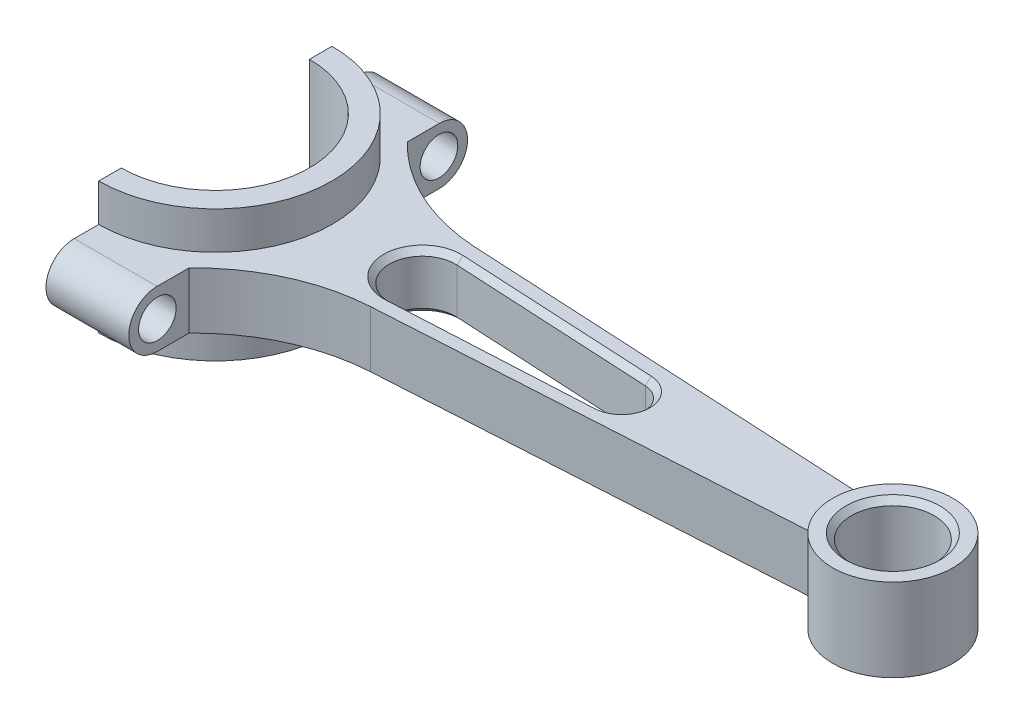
ISO-10303-21;
HEADER;
FILE_DESCRIPTION(('STEP AP214'),'2;1');
FILE_NAME('part.step','',(''),(''),'','','');
FILE_SCHEMA(('AUTOMOTIVE_DESIGN { 1 0 10303 214 1 1 1 1 }'));
ENDSEC;
DATA;
#1=APPLICATION_CONTEXT('core data for automotive mechanical design processes');
#2=APPLICATION_PROTOCOL_DEFINITION('international standard','automotive_design',2000,#1);
#3=PRODUCT_CONTEXT('',#1,'mechanical');
#4=PRODUCT('Part','Part','',(#3));
#5=PRODUCT_RELATED_PRODUCT_CATEGORY('part','',(#4));
#6=PRODUCT_DEFINITION_FORMATION('','',#4);
#7=PRODUCT_DEFINITION_CONTEXT('part definition',#1,'design');
#8=PRODUCT_DEFINITION('design','',#6,#7);
#9=PRODUCT_DEFINITION_SHAPE('','',#8);
#10=(LENGTH_UNIT() NAMED_UNIT(*) SI_UNIT(.MILLI.,.METRE.));
#11=(NAMED_UNIT(*) PLANE_ANGLE_UNIT() SI_UNIT($,.RADIAN.));
#12=(NAMED_UNIT(*) SI_UNIT($,.STERADIAN.) SOLID_ANGLE_UNIT());
#13=UNCERTAINTY_MEASURE_WITH_UNIT(LENGTH_MEASURE(1.E-05),#10,'distance_accuracy_value','');
#14=(GEOMETRIC_REPRESENTATION_CONTEXT(3) GLOBAL_UNCERTAINTY_ASSIGNED_CONTEXT((#13)) GLOBAL_UNIT_ASSIGNED_CONTEXT((#10,
#11,#12)) REPRESENTATION_CONTEXT('',''));
#15=CARTESIAN_POINT('',(0.,0.,0.));
#16=DIRECTION('',(0.,0.,1.));
#17=DIRECTION('',(1.,0.,0.));
#18=AXIS2_PLACEMENT_3D('',#15,#16,#17);
#19=CARTESIAN_POINT('',(22.,0.,-37.5));
#20=DIRECTION('',(1.,0.,0.));
#21=DIRECTION('',(0.,0.,-1.));
#22=AXIS2_PLACEMENT_3D('',#19,#20,#21);
#23=CYLINDRICAL_SURFACE('',#22,7.5);
#24=DIRECTION('',(1.,0.,0.));
#25=VECTOR('',#24,1.);
#26=CARTESIAN_POINT('',(0.,7.5,-37.5));
#27=LINE('',#26,#25);
#28=CARTESIAN_POINT('',(22.,7.5,-37.5));
#29=VERTEX_POINT('',#28);
#30=CARTESIAN_POINT('',(0.,7.5,-37.5));
#31=VERTEX_POINT('',#30);
#32=EDGE_CURVE('E350',#29,#31,#27,.F.);
#33=ORIENTED_EDGE('',*,*,#32,.F.);
#34=CARTESIAN_POINT('',(22.,0.,-37.5));
#35=DIRECTION('',(1.,0.,0.));
#36=DIRECTION('',(0.,0.,-1.));
#37=AXIS2_PLACEMENT_3D('',#34,#35,#36);
#38=CIRCLE('',#37,7.5);
#39=CARTESIAN_POINT('',(22.,-7.5,-37.5));
#40=VERTEX_POINT('',#39);
#41=EDGE_CURVE('E356',#40,#29,#38,.T.);
#42=ORIENTED_EDGE('',*,*,#41,.F.);
#43=DIRECTION('',(-1.,0.,0.));
#44=VECTOR('',#43,1.);
#45=CARTESIAN_POINT('',(22.,-7.5,-37.5));
#46=LINE('',#45,#44);
#47=CARTESIAN_POINT('',(0.,-7.5,-37.5));
#48=VERTEX_POINT('',#47);
#49=EDGE_CURVE('E353',#48,#40,#46,.F.);
#50=ORIENTED_EDGE('',*,*,#49,.F.);
#51=CARTESIAN_POINT('',(0.,0.,-37.5));
#52=DIRECTION('',(-1.,0.,0.));
#53=DIRECTION('',(0.,0.,1.));
#54=AXIS2_PLACEMENT_3D('',#51,#52,#53);
#55=CIRCLE('',#54,7.5);
#56=EDGE_CURVE('E358',#31,#48,#55,.T.);
#57=ORIENTED_EDGE('',*,*,#56,.F.);
#58=EDGE_LOOP('',(#33,#42,#50,#57));
#59=FACE_BOUND('',#58,.T.);
#60=ADVANCED_FACE('F41',(#59),#23,.T.);
#61=CARTESIAN_POINT('',(0.,0.,37.5));
#62=DIRECTION('',(1.,0.,0.));
#63=DIRECTION('',(0.,0.,-1.));
#64=AXIS2_PLACEMENT_3D('',#61,#62,#63);
#65=CYLINDRICAL_SURFACE('',#64,7.5);
#66=DIRECTION('',(-1.,0.,0.));
#67=VECTOR('',#66,1.);
#68=CARTESIAN_POINT('',(0.,7.5,37.5));
#69=LINE('',#68,#67);
#70=CARTESIAN_POINT('',(0.,7.5,37.5));
#71=VERTEX_POINT('',#70);
#72=CARTESIAN_POINT('',(22.,7.5,37.5));
#73=VERTEX_POINT('',#72);
#74=EDGE_CURVE('E330',#71,#73,#69,.F.);
#75=ORIENTED_EDGE('',*,*,#74,.F.);
#76=CARTESIAN_POINT('',(0.,0.,37.5));
#77=DIRECTION('',(-1.,0.,0.));
#78=DIRECTION('',(0.,0.,1.));
#79=AXIS2_PLACEMENT_3D('',#76,#77,#78);
#80=CIRCLE('',#79,7.5);
#81=CARTESIAN_POINT('',(0.,-7.5,37.5));
#82=VERTEX_POINT('',#81);
#83=EDGE_CURVE('E346',#82,#71,#80,.T.);
#84=ORIENTED_EDGE('',*,*,#83,.F.);
#85=DIRECTION('',(1.,0.,0.));
#86=VECTOR('',#85,1.);
#87=CARTESIAN_POINT('',(0.,-7.5,37.5));
#88=LINE('',#87,#86);
#89=CARTESIAN_POINT('',(22.,-7.5,37.5));
#90=VERTEX_POINT('',#89);
#91=EDGE_CURVE('E343',#90,#82,#88,.F.);
#92=ORIENTED_EDGE('',*,*,#91,.F.);
#93=CARTESIAN_POINT('',(22.,0.,37.5));
#94=DIRECTION('',(-1.,0.,0.));
#95=DIRECTION('',(0.,0.,1.));
#96=AXIS2_PLACEMENT_3D('',#93,#94,#95);
#97=CIRCLE('',#96,7.5);
#98=EDGE_CURVE('E348',#73,#90,#97,.F.);
#99=ORIENTED_EDGE('',*,*,#98,.F.);
#100=EDGE_LOOP('',(#75,#84,#92,#99));
#101=FACE_BOUND('',#100,.T.);
#102=ADVANCED_FACE('F496',(#101),#65,.T.);
#103=CARTESIAN_POINT('',(0.871308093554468,7.5,-16.6255488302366));
#104=DIRECTION('',(0.052335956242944,0.,-0.998629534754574));
#105=DIRECTION('',(-0.998629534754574,0.,-0.052335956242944));
#106=AXIS2_PLACEMENT_3D('',#103,#104,#105);
#107=PLANE('',#106);
#108=DIRECTION('',(0.998629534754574,0.,0.052335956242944));
#109=VECTOR('',#108,1.);
#110=CARTESIAN_POINT('',(0.871308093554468,-7.5,-16.6255488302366));
#111=LINE('',#110,#109);
#112=CARTESIAN_POINT('',(55.,-7.5,-13.7887842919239));
#113=VERTEX_POINT('',#112);
#114=CARTESIAN_POINT('',(166.123473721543,-7.5,-7.96504980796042));
#115=VERTEX_POINT('',#114);
#116=EDGE_CURVE('E290',#113,#115,#111,.T.);
#117=ORIENTED_EDGE('',*,*,#116,.F.);
#118=DIRECTION('',(0.,-1.,0.));
#119=VECTOR('',#118,1.);
#120=CARTESIAN_POINT('',(55.,7.5,-13.7887842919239));
#121=LINE('',#120,#119);
#122=CARTESIAN_POINT('',(55.,7.5,-13.7887842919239));
#123=VERTEX_POINT('',#122);
#124=EDGE_CURVE('E325',#123,#113,#121,.T.);
#125=ORIENTED_EDGE('',*,*,#124,.F.);
#126=DIRECTION('',(0.998629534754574,0.,0.052335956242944));
#127=VECTOR('',#126,1.);
#128=CARTESIAN_POINT('',(0.871308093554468,7.5,-16.6255488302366));
#129=LINE('',#128,#127);
#130=CARTESIAN_POINT('',(166.123473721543,7.5,-7.96504980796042));
#131=VERTEX_POINT('',#130);
#132=EDGE_CURVE('E265',#123,#131,#129,.T.);
#133=ORIENTED_EDGE('',*,*,#132,.T.);
#134=DIRECTION('',(0.,-1.,0.));
#135=VECTOR('',#134,1.);
#136=CARTESIAN_POINT('',(166.123473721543,7.5,-7.96504980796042));
#137=LINE('',#136,#135);
#138=EDGE_CURVE('E327',#131,#115,#137,.T.);
#139=ORIENTED_EDGE('',*,*,#138,.T.);
#140=EDGE_LOOP('',(#117,#125,#133,#139));
#141=FACE_BOUND('',#140,.T.);
#142=ADVANCED_FACE('F514',(#141),#107,.T.);
#143=CARTESIAN_POINT('',(58.,7.5,-63.698703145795));
#144=DIRECTION('',(0.,-1.,0.));
#145=DIRECTION('',(0.,0.,-1.));
#146=AXIS2_PLACEMENT_3D('',#143,#144,#145);
#147=CYLINDRICAL_SURFACE('',#146,50.);
#148=CARTESIAN_POINT('',(58.,-7.5,-63.698703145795));
#149=DIRECTION('',(0.,1.,0.));
#150=DIRECTION('',(0.,0.,1.));
#151=AXIS2_PLACEMENT_3D('',#148,#149,#150);
#152=CIRCLE('',#151,50.);
#153=CARTESIAN_POINT('',(22.,-7.5,-29.));
#154=VERTEX_POINT('',#153);
#155=EDGE_CURVE('E293',#154,#113,#152,.T.);
#156=ORIENTED_EDGE('',*,*,#155,.F.);
#157=DIRECTION('',(0.,-1.,0.));
#158=VECTOR('',#157,1.);
#159=CARTESIAN_POINT('',(22.,7.5,-29.));
#160=LINE('',#159,#158);
#161=CARTESIAN_POINT('',(22.,7.5,-29.));
#162=VERTEX_POINT('',#161);
#163=EDGE_CURVE('E322',#162,#154,#160,.T.);
#164=ORIENTED_EDGE('',*,*,#163,.F.);
#165=CARTESIAN_POINT('',(58.,7.5,-63.698703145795));
#166=DIRECTION('',(0.,1.,0.));
#167=DIRECTION('',(0.,0.,1.));
#168=AXIS2_PLACEMENT_3D('',#165,#166,#167);
#169=CIRCLE('',#168,50.);
#170=EDGE_CURVE('E269',#162,#123,#169,.T.);
#171=ORIENTED_EDGE('',*,*,#170,.T.);
#172=ORIENTED_EDGE('',*,*,#124,.T.);
#173=EDGE_LOOP('',(#156,#164,#171,#172));
#174=FACE_BOUND('',#173,.T.);
#175=ADVANCED_FACE('F482',(#174),#147,.F.);
#176=CARTESIAN_POINT('',(22.,7.5,0.));
#177=DIRECTION('',(1.,0.,0.));
#178=DIRECTION('',(0.,0.,-1.));
#179=AXIS2_PLACEMENT_3D('',#176,#177,#178);
#180=PLANE('',#179);
#181=CARTESIAN_POINT('',(22.,0.,-37.4068380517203));
#182=DIRECTION('',(1.,0.,0.));
#183=DIRECTION('',(0.,0.,-1.));
#184=AXIS2_PLACEMENT_3D('',#181,#182,#183);
#185=CIRCLE('',#184,5.00000000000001);
#186=CARTESIAN_POINT('',(22.,0.,-42.4068380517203));
#187=VERTEX_POINT('',#186);
#188=EDGE_CURVE('E413',#187,#187,#185,.T.);
#189=ORIENTED_EDGE('',*,*,#188,.F.);
#190=EDGE_LOOP('',(#189));
#191=FACE_BOUND('',#190,.T.);
#192=DIRECTION('',(0.,0.,1.));
#193=VECTOR('',#192,1.);
#194=CARTESIAN_POINT('',(22.,-7.5,0.));
#195=LINE('',#194,#193);
#196=EDGE_CURVE('E296',#40,#154,#195,.T.);
#197=ORIENTED_EDGE('',*,*,#196,.F.);
#198=ORIENTED_EDGE('',*,*,#41,.T.);
#199=DIRECTION('',(0.,0.,1.));
#200=VECTOR('',#199,1.);
#201=CARTESIAN_POINT('',(22.,7.5,0.));
#202=LINE('',#201,#200);
#203=EDGE_CURVE('E272',#29,#162,#202,.T.);
#204=ORIENTED_EDGE('',*,*,#203,.T.);
#205=ORIENTED_EDGE('',*,*,#163,.T.);
#206=EDGE_LOOP('',(#197,#198,#204,#205));
#207=FACE_BOUND('',#206,.T.);
#208=ADVANCED_FACE('F479',(#191,#207),#180,.T.);
#209=CARTESIAN_POINT('',(0.,7.5,0.));
#210=DIRECTION('',(-1.,0.,0.));
#211=DIRECTION('',(0.,0.,1.));
#212=AXIS2_PLACEMENT_3D('',#209,#210,#211);
#213=PLANE('',#212);
#214=CARTESIAN_POINT('',(0.,0.,-37.4068380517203));
#215=DIRECTION('',(1.,0.,0.));
#216=DIRECTION('',(0.,0.,-1.));
#217=AXIS2_PLACEMENT_3D('',#214,#215,#216);
#218=CIRCLE('',#217,5.00000000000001);
#219=CARTESIAN_POINT('',(0.,0.,-42.4068380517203));
#220=VERTEX_POINT('',#219);
#221=EDGE_CURVE('E876',#220,#220,#218,.T.);
#222=ORIENTED_EDGE('',*,*,#221,.T.);
#223=EDGE_LOOP('',(#222));
#224=FACE_BOUND('',#223,.T.);
#225=DIRECTION('',(0.,0.,-1.));
#226=VECTOR('',#225,1.);
#227=CARTESIAN_POINT('',(0.,7.5,0.));
#228=LINE('',#227,#226);
#229=CARTESIAN_POINT('',(0.,7.5,-31.));
#230=VERTEX_POINT('',#229);
#231=EDGE_CURVE('E274',#230,#31,#228,.T.);
#232=ORIENTED_EDGE('',*,*,#231,.T.);
#233=ORIENTED_EDGE('',*,*,#56,.T.);
#234=DIRECTION('',(0.,0.,-1.));
#235=VECTOR('',#234,1.);
#236=CARTESIAN_POINT('',(0.,-7.5,0.));
#237=LINE('',#236,#235);
#238=CARTESIAN_POINT('',(0.,-7.5,-31.));
#239=VERTEX_POINT('',#238);
#240=EDGE_CURVE('E298',#239,#48,#237,.T.);
#241=ORIENTED_EDGE('',*,*,#240,.F.);
#242=DIRECTION('',(0.,-1.,0.));
#243=VECTOR('',#242,1.);
#244=CARTESIAN_POINT('',(0.,17.5,-31.));
#245=LINE('',#244,#243);
#246=CARTESIAN_POINT('',(0.,-17.5,-31.));
#247=VERTEX_POINT('',#246);
#248=EDGE_CURVE('E219',#239,#247,#245,.T.);
#249=ORIENTED_EDGE('',*,*,#248,.T.);
#250=DIRECTION('',(0.,0.,-1.));
#251=VECTOR('',#250,1.);
#252=CARTESIAN_POINT('',(0.,-17.5,0.));
#253=LINE('',#252,#251);
#254=CARTESIAN_POINT('',(0.,-17.5,-25.));
#255=VERTEX_POINT('',#254);
#256=EDGE_CURVE('E243',#255,#247,#253,.T.);
#257=ORIENTED_EDGE('',*,*,#256,.F.);
#258=DIRECTION('',(0.,-1.,0.));
#259=VECTOR('',#258,1.);
#260=CARTESIAN_POINT('',(0.,17.5,-25.));
#261=LINE('',#260,#259);
#262=CARTESIAN_POINT('',(0.,17.5,-25.));
#263=VERTEX_POINT('',#262);
#264=EDGE_CURVE('E231',#263,#255,#261,.T.);
#265=ORIENTED_EDGE('',*,*,#264,.F.);
#266=DIRECTION('',(0.,0.,-1.));
#267=VECTOR('',#266,1.);
#268=CARTESIAN_POINT('',(0.,17.5,0.));
#269=LINE('',#268,#267);
#270=CARTESIAN_POINT('',(0.,17.5,-31.));
#271=VERTEX_POINT('',#270);
#272=EDGE_CURVE('E224',#263,#271,#269,.T.);
#273=ORIENTED_EDGE('',*,*,#272,.T.);
#274=EDGE_CURVE('E207',#271,#230,#245,.T.);
#275=ORIENTED_EDGE('',*,*,#274,.T.);
#276=EDGE_LOOP('',(#232,#233,#241,#249,#257,#265,#273,#275));
#277=FACE_BOUND('',#276,.T.);
#278=ADVANCED_FACE('F229',(#224,#277),#213,.T.);
#279=CARTESIAN_POINT('',(0.,7.5,0.));
#280=DIRECTION('',(-1.,0.,0.));
#281=DIRECTION('',(0.,0.,1.));
#282=AXIS2_PLACEMENT_3D('',#279,#280,#281);
#283=PLANE('',#282);
#284=CARTESIAN_POINT('',(0.,0.,37.4068380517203));
#285=DIRECTION('',(1.,0.,0.));
#286=DIRECTION('',(0.,0.,-1.));
#287=AXIS2_PLACEMENT_3D('',#284,#285,#286);
#288=CIRCLE('',#287,5.00000000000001);
#289=CARTESIAN_POINT('',(0.,0.,32.4068380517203));
#290=VERTEX_POINT('',#289);
#291=EDGE_CURVE('E244',#290,#290,#288,.T.);
#292=ORIENTED_EDGE('',*,*,#291,.T.);
#293=EDGE_LOOP('',(#292));
#294=FACE_BOUND('',#293,.T.);
#295=DIRECTION('',(0.,0.,-1.));
#296=VECTOR('',#295,1.);
#297=CARTESIAN_POINT('',(0.,-7.5,0.));
#298=LINE('',#297,#296);
#299=CARTESIAN_POINT('',(0.,-7.5,31.));
#300=VERTEX_POINT('',#299);
#301=EDGE_CURVE('E304',#82,#300,#298,.T.);
#302=ORIENTED_EDGE('',*,*,#301,.F.);
#303=ORIENTED_EDGE('',*,*,#83,.T.);
#304=DIRECTION('',(0.,0.,-1.));
#305=VECTOR('',#304,1.);
#306=CARTESIAN_POINT('',(0.,7.5,0.));
#307=LINE('',#306,#305);
#308=CARTESIAN_POINT('',(0.,7.5,31.));
#309=VERTEX_POINT('',#308);
#310=EDGE_CURVE('E277',#71,#309,#307,.T.);
#311=ORIENTED_EDGE('',*,*,#310,.T.);
#312=DIRECTION('',(0.,-1.,0.));
#313=VECTOR('',#312,1.);
#314=CARTESIAN_POINT('',(0.,17.5,31.));
#315=LINE('',#314,#313);
#316=CARTESIAN_POINT('',(0.,17.5,31.));
#317=VERTEX_POINT('',#316);
#318=EDGE_CURVE('E252',#317,#309,#315,.T.);
#319=ORIENTED_EDGE('',*,*,#318,.F.);
#320=DIRECTION('',(0.,0.,-1.));
#321=VECTOR('',#320,1.);
#322=CARTESIAN_POINT('',(0.,17.5,0.));
#323=LINE('',#322,#321);
#324=CARTESIAN_POINT('',(0.,17.5,25.));
#325=VERTEX_POINT('',#324);
#326=EDGE_CURVE('E226',#317,#325,#323,.T.);
#327=ORIENTED_EDGE('',*,*,#326,.T.);
#328=DIRECTION('',(0.,-1.,0.));
#329=VECTOR('',#328,1.);
#330=CARTESIAN_POINT('',(0.,17.5,25.));
#331=LINE('',#330,#329);
#332=CARTESIAN_POINT('',(0.,-17.5,25.));
#333=VERTEX_POINT('',#332);
#334=EDGE_CURVE('E254',#325,#333,#331,.T.);
#335=ORIENTED_EDGE('',*,*,#334,.T.);
#336=DIRECTION('',(0.,0.,-1.));
#337=VECTOR('',#336,1.);
#338=CARTESIAN_POINT('',(0.,-17.5,0.));
#339=LINE('',#338,#337);
#340=CARTESIAN_POINT('',(0.,-17.5,31.));
#341=VERTEX_POINT('',#340);
#342=EDGE_CURVE('E227',#341,#333,#339,.T.);
#343=ORIENTED_EDGE('',*,*,#342,.F.);
#344=EDGE_CURVE('E239',#300,#341,#315,.T.);
#345=ORIENTED_EDGE('',*,*,#344,.F.);
#346=EDGE_LOOP('',(#302,#303,#311,#319,#327,#335,#343,#345));
#347=FACE_BOUND('',#346,.T.);
#348=ADVANCED_FACE('F491',(#294,#347),#283,.T.);
#349=CARTESIAN_POINT('',(22.,7.5,0.));
#350=DIRECTION('',(-1.,0.,0.));
#351=DIRECTION('',(0.,0.,1.));
#352=AXIS2_PLACEMENT_3D('',#349,#350,#351);
#353=PLANE('',#352);
#354=CARTESIAN_POINT('',(22.,0.,37.4068380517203));
#355=DIRECTION('',(1.,0.,0.));
#356=DIRECTION('',(0.,0.,-1.));
#357=AXIS2_PLACEMENT_3D('',#354,#355,#356);
#358=CIRCLE('',#357,5.00000000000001);
#359=CARTESIAN_POINT('',(22.,0.,32.4068380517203));
#360=VERTEX_POINT('',#359);
#361=EDGE_CURVE('E879',#360,#360,#358,.T.);
#362=ORIENTED_EDGE('',*,*,#361,.F.);
#363=EDGE_LOOP('',(#362));
#364=FACE_BOUND('',#363,.T.);
#365=DIRECTION('',(0.,0.,-1.));
#366=VECTOR('',#365,1.);
#367=CARTESIAN_POINT('',(22.,7.5,0.));
#368=LINE('',#367,#366);
#369=CARTESIAN_POINT('',(22.,7.5,29.));
#370=VERTEX_POINT('',#369);
#371=EDGE_CURVE('E279',#73,#370,#368,.T.);
#372=ORIENTED_EDGE('',*,*,#371,.F.);
#373=ORIENTED_EDGE('',*,*,#98,.T.);
#374=DIRECTION('',(0.,0.,-1.));
#375=VECTOR('',#374,1.);
#376=CARTESIAN_POINT('',(22.,-7.5,0.));
#377=LINE('',#376,#375);
#378=CARTESIAN_POINT('',(22.,-7.5,29.));
#379=VERTEX_POINT('',#378);
#380=EDGE_CURVE('E306',#90,#379,#377,.T.);
#381=ORIENTED_EDGE('',*,*,#380,.T.);
#382=DIRECTION('',(0.,-1.,0.));
#383=VECTOR('',#382,1.);
#384=CARTESIAN_POINT('',(22.,7.5,29.));
#385=LINE('',#384,#383);
#386=EDGE_CURVE('E319',#370,#379,#385,.T.);
#387=ORIENTED_EDGE('',*,*,#386,.F.);
#388=EDGE_LOOP('',(#372,#373,#381,#387));
#389=FACE_BOUND('',#388,.T.);
#390=ADVANCED_FACE('F501',(#364,#389),#353,.F.);
#391=CARTESIAN_POINT('',(58.,7.5,63.698703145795));
#392=DIRECTION('',(0.,-1.,0.));
#393=DIRECTION('',(0.,0.,-1.));
#394=AXIS2_PLACEMENT_3D('',#391,#392,#393);
#395=CYLINDRICAL_SURFACE('',#394,50.);
#396=CARTESIAN_POINT('',(58.,-7.5,63.698703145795));
#397=DIRECTION('',(0.,1.,0.));
#398=DIRECTION('',(0.,0.,1.));
#399=AXIS2_PLACEMENT_3D('',#396,#397,#398);
#400=CIRCLE('',#399,50.);
#401=CARTESIAN_POINT('',(55.,-7.5,13.7887842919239));
#402=VERTEX_POINT('',#401);
#403=EDGE_CURVE('E308',#379,#402,#400,.F.);
#404=ORIENTED_EDGE('',*,*,#403,.T.);
#405=DIRECTION('',(0.,-1.,0.));
#406=VECTOR('',#405,1.);
#407=CARTESIAN_POINT('',(55.,7.5,13.7887842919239));
#408=LINE('',#407,#406);
#409=CARTESIAN_POINT('',(55.,7.5,13.7887842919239));
#410=VERTEX_POINT('',#409);
#411=EDGE_CURVE('E315',#410,#402,#408,.T.);
#412=ORIENTED_EDGE('',*,*,#411,.F.);
#413=CARTESIAN_POINT('',(58.,7.5,63.698703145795));
#414=DIRECTION('',(0.,1.,0.));
#415=DIRECTION('',(0.,0.,1.));
#416=AXIS2_PLACEMENT_3D('',#413,#414,#415);
#417=CIRCLE('',#416,50.);
#418=EDGE_CURVE('E281',#370,#410,#417,.F.);
#419=ORIENTED_EDGE('',*,*,#418,.F.);
#420=ORIENTED_EDGE('',*,*,#386,.T.);
#421=EDGE_LOOP('',(#404,#412,#419,#420));
#422=FACE_BOUND('',#421,.T.);
#423=ADVANCED_FACE('F505',(#422),#395,.F.);
#424=CARTESIAN_POINT('',(55.,7.5,0.));
#425=DIRECTION('',(0.,-1.,0.));
#426=DIRECTION('',(0.,0.,-1.));
#427=AXIS2_PLACEMENT_3D('',#424,#425,#426);
#428=CYLINDRICAL_SURFACE('',#427,8.76988724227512);
#429=DIRECTION('',(0.,-1.,0.));
#430=VECTOR('',#429,1.);
#431=CARTESIAN_POINT('',(55.4589804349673,7.5,-8.75786841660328));
#432=LINE('',#431,#430);
#433=CARTESIAN_POINT('',(55.4589804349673,6.00000000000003,-8.75786841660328));
#434=VERTEX_POINT('',#433);
#435=CARTESIAN_POINT('',(55.4589804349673,-5.99999999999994,-8.75786841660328));
#436=VERTEX_POINT('',#435);
#437=EDGE_CURVE('E316',#434,#436,#432,.T.);
#438=ORIENTED_EDGE('',*,*,#437,.F.);
#439=CARTESIAN_POINT('',(55.,6.00000000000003,0.));
#440=DIRECTION('',(0.,1.,0.));
#441=DIRECTION('',(0.,0.,1.));
#442=AXIS2_PLACEMENT_3D('',#439,#440,#441);
#443=CIRCLE('',#442,8.76988724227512);
#444=CARTESIAN_POINT('',(55.4589804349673,6.00000000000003,8.75786841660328));
#445=VERTEX_POINT('',#444);
#446=EDGE_CURVE('E397',#434,#445,#443,.T.);
#447=ORIENTED_EDGE('',*,*,#446,.T.);
#448=DIRECTION('',(0.,-1.,0.));
#449=VECTOR('',#448,1.);
#450=CARTESIAN_POINT('',(55.4589804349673,7.5,8.75786841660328));
#451=LINE('',#450,#449);
#452=CARTESIAN_POINT('',(55.4589804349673,-5.99999999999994,8.75786841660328));
#453=VERTEX_POINT('',#452);
#454=EDGE_CURVE('E287',#445,#453,#451,.T.);
#455=ORIENTED_EDGE('',*,*,#454,.T.);
#456=CARTESIAN_POINT('',(55.,-5.99999999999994,0.));
#457=DIRECTION('',(0.,1.,0.));
#458=DIRECTION('',(0.,0.,1.));
#459=AXIS2_PLACEMENT_3D('',#456,#457,#458);
#460=CIRCLE('',#459,8.76988724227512);
#461=EDGE_CURVE('E395',#453,#436,#460,.F.);
#462=ORIENTED_EDGE('',*,*,#461,.T.);
#463=EDGE_LOOP('',(#438,#447,#455,#462));
#464=FACE_BOUND('',#463,.T.);
#465=ADVANCED_FACE('F458',(#464),#428,.F.);
#466=CARTESIAN_POINT('',(0.609628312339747,7.5,-11.6324011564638));
#467=DIRECTION('',(0.0523359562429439,0.,-0.998629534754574));
#468=DIRECTION('',(-0.998629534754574,0.,-0.0523359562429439));
#469=AXIS2_PLACEMENT_3D('',#466,#467,#468);
#470=PLANE('',#469);
#471=DIRECTION('',(0.,-1.,0.));
#472=VECTOR('',#471,1.);
#473=CARTESIAN_POINT('',(108.239144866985,7.5,-5.99177720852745));
#474=LINE('',#473,#472);
#475=CARTESIAN_POINT('',(108.239144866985,6.00000000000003,-5.99177720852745));
#476=VERTEX_POINT('',#475);
#477=CARTESIAN_POINT('',(108.239144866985,-5.99999999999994,-5.99177720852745));
#478=VERTEX_POINT('',#477);
#479=EDGE_CURVE('E336',#476,#478,#474,.T.);
#480=ORIENTED_EDGE('',*,*,#479,.F.);
#481=DIRECTION('',(-0.998629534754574,0.,-0.0523359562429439));
#482=VECTOR('',#481,1.);
#483=CARTESIAN_POINT('',(55.4589804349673,6.00000000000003,-8.75786841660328));
#484=LINE('',#483,#482);
#485=EDGE_CURVE('E389',#476,#434,#484,.T.);
#486=ORIENTED_EDGE('',*,*,#485,.T.);
#487=ORIENTED_EDGE('',*,*,#437,.T.);
#488=DIRECTION('',(0.998629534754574,0.,0.0523359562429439));
#489=VECTOR('',#488,1.);
#490=CARTESIAN_POINT('',(0.609628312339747,-5.99999999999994,-11.6324011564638));
#491=LINE('',#490,#489);
#492=EDGE_CURVE('E387',#436,#478,#491,.T.);
#493=ORIENTED_EDGE('',*,*,#492,.T.);
#494=EDGE_LOOP('',(#480,#486,#487,#493));
#495=FACE_BOUND('',#494,.T.);
#496=ADVANCED_FACE('F454',(#495),#470,.F.);
#497=CARTESIAN_POINT('',(107.925129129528,7.5,0.));
#498=DIRECTION('',(0.,-1.,0.));
#499=DIRECTION('',(0.,0.,-1.));
#500=AXIS2_PLACEMENT_3D('',#497,#498,#499);
#501=CYLINDRICAL_SURFACE('',#500,6.);
#502=DIRECTION('',(0.,-1.,0.));
#503=VECTOR('',#502,1.);
#504=CARTESIAN_POINT('',(108.239144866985,7.5,5.99177720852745));
#505=LINE('',#504,#503);
#506=CARTESIAN_POINT('',(108.239144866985,6.00000000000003,5.99177720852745));
#507=VERTEX_POINT('',#506);
#508=CARTESIAN_POINT('',(108.239144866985,-5.99999999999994,5.99177720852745));
#509=VERTEX_POINT('',#508);
#510=EDGE_CURVE('E333',#507,#509,#505,.T.);
#511=ORIENTED_EDGE('',*,*,#510,.F.);
#512=CARTESIAN_POINT('',(107.925129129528,6.00000000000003,0.));
#513=DIRECTION('',(0.,1.,0.));
#514=DIRECTION('',(0.,0.,1.));
#515=AXIS2_PLACEMENT_3D('',#512,#513,#514);
#516=CIRCLE('',#515,6.);
#517=EDGE_CURVE('E384',#507,#476,#516,.T.);
#518=ORIENTED_EDGE('',*,*,#517,.T.);
#519=ORIENTED_EDGE('',*,*,#479,.T.);
#520=CARTESIAN_POINT('',(107.925129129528,-5.99999999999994,0.));
#521=DIRECTION('',(0.,1.,0.));
#522=DIRECTION('',(0.,0.,1.));
#523=AXIS2_PLACEMENT_3D('',#520,#521,#522);
#524=CIRCLE('',#523,6.);
#525=EDGE_CURVE('E381',#478,#509,#524,.F.);
#526=ORIENTED_EDGE('',*,*,#525,.T.);
#527=EDGE_LOOP('',(#511,#518,#519,#526));
#528=FACE_BOUND('',#527,.T.);
#529=ADVANCED_FACE('F438',(#528),#501,.F.);
#530=CARTESIAN_POINT('',(0.609628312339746,7.5,11.6324011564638));
#531=DIRECTION('',(0.0523359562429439,0.,0.998629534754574));
#532=DIRECTION('',(0.998629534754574,0.,-0.0523359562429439));
#533=AXIS2_PLACEMENT_3D('',#530,#531,#532);
#534=PLANE('',#533);
#535=ORIENTED_EDGE('',*,*,#454,.F.);
#536=DIRECTION('',(0.998629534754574,0.,-0.0523359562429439));
#537=VECTOR('',#536,1.);
#538=CARTESIAN_POINT('',(108.239144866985,6.00000000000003,5.99177720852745));
#539=LINE('',#538,#537);
#540=EDGE_CURVE('E393',#445,#507,#539,.T.);
#541=ORIENTED_EDGE('',*,*,#540,.T.);
#542=ORIENTED_EDGE('',*,*,#510,.T.);
#543=DIRECTION('',(-0.998629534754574,0.,0.0523359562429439));
#544=VECTOR('',#543,1.);
#545=CARTESIAN_POINT('',(0.609628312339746,-5.99999999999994,11.6324011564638));
#546=LINE('',#545,#544);
#547=EDGE_CURVE('E391',#509,#453,#546,.T.);
#548=ORIENTED_EDGE('',*,*,#547,.T.);
#549=EDGE_LOOP('',(#535,#541,#542,#548));
#550=FACE_BOUND('',#549,.T.);
#551=ADVANCED_FACE('F441',(#550),#534,.F.);
#552=CARTESIAN_POINT('',(1.02383652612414,7.5,17.0331993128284));
#553=DIRECTION('',(-0.0599999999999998,0.,-0.998198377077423));
#554=DIRECTION('',(-0.998198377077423,0.,0.0599999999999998));
#555=AXIS2_PLACEMENT_3D('',#552,#553,#554);
#556=PLANE('',#555);
#557=DIRECTION('',(0.998198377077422,0.,-0.0599999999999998));
#558=VECTOR('',#557,1.);
#559=CARTESIAN_POINT('',(1.02383652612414,-7.5,17.0331993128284));
#560=LINE('',#559,#558);
#561=CARTESIAN_POINT('',(165.679487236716,-7.5,7.13602930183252));
#562=VERTEX_POINT('',#561);
#563=EDGE_CURVE('E266',#402,#562,#560,.T.);
#564=ORIENTED_EDGE('',*,*,#563,.T.);
#565=DIRECTION('',(0.,-1.,0.));
#566=VECTOR('',#565,1.);
#567=CARTESIAN_POINT('',(165.679487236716,7.5,7.13602930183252));
#568=LINE('',#567,#566);
#569=CARTESIAN_POINT('',(165.679487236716,7.5,7.13602930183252));
#570=VERTEX_POINT('',#569);
#571=EDGE_CURVE('E313',#570,#562,#568,.T.);
#572=ORIENTED_EDGE('',*,*,#571,.F.);
#573=DIRECTION('',(0.998198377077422,0.,-0.0599999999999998));
#574=VECTOR('',#573,1.);
#575=CARTESIAN_POINT('',(1.02383652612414,7.5,17.0331993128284));
#576=LINE('',#575,#574);
#577=EDGE_CURVE('E284',#410,#570,#576,.T.);
#578=ORIENTED_EDGE('',*,*,#577,.F.);
#579=ORIENTED_EDGE('',*,*,#411,.T.);
#580=EDGE_LOOP('',(#564,#572,#578,#579));
#581=FACE_BOUND('',#580,.T.);
#582=ADVANCED_FACE('F470',(#581),#556,.F.);
#583=CARTESIAN_POINT('',(0.,7.5,0.));
#584=DIRECTION('',(0.,1.,0.));
#585=DIRECTION('',(0.,0.,1.));
#586=AXIS2_PLACEMENT_3D('',#583,#584,#585);
#587=PLANE('',#586);
#588=DIRECTION('',(0.998629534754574,0.,0.0523359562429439));
#589=VECTOR('',#588,1.);
#590=CARTESIAN_POINT('',(108.31764880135,7.5,-7.48972151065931));
#591=LINE('',#590,#589);
#592=CARTESIAN_POINT('',(55.5374843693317,7.5,-10.2558127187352));
#593=VERTEX_POINT('',#592);
#594=CARTESIAN_POINT('',(108.31764880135,7.5,-7.48972151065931));
#595=VERTEX_POINT('',#594);
#596=EDGE_CURVE('E376',#593,#595,#591,.T.);
#597=ORIENTED_EDGE('',*,*,#596,.T.);
#598=CARTESIAN_POINT('',(107.925129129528,7.5,0.));
#599=DIRECTION('',(0.,1.,0.));
#600=DIRECTION('',(0.,0.,1.));
#601=AXIS2_PLACEMENT_3D('',#598,#599,#600);
#602=CIRCLE('',#601,7.5);
#603=CARTESIAN_POINT('',(108.31764880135,7.5,7.48972151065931));
#604=VERTEX_POINT('',#603);
#605=EDGE_CURVE('E378',#595,#604,#602,.F.);
#606=ORIENTED_EDGE('',*,*,#605,.T.);
#607=DIRECTION('',(-0.998629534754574,0.,0.0523359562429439));
#608=VECTOR('',#607,1.);
#609=CARTESIAN_POINT('',(55.5374843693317,7.5,10.2558127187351));
#610=LINE('',#609,#608);
#611=CARTESIAN_POINT('',(55.5374843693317,7.5,10.2558127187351));
#612=VERTEX_POINT('',#611);
#613=EDGE_CURVE('E374',#604,#612,#610,.T.);
#614=ORIENTED_EDGE('',*,*,#613,.T.);
#615=CARTESIAN_POINT('',(55.,7.5,0.));
#616=DIRECTION('',(0.,1.,0.));
#617=DIRECTION('',(0.,0.,1.));
#618=AXIS2_PLACEMENT_3D('',#615,#616,#617);
#619=CIRCLE('',#618,10.2698872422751);
#620=EDGE_CURVE('E372',#612,#593,#619,.F.);
#621=ORIENTED_EDGE('',*,*,#620,.T.);
#622=EDGE_LOOP('',(#597,#606,#614,#621));
#623=FACE_BOUND('',#622,.T.);
#624=ORIENTED_EDGE('',*,*,#203,.F.);
#625=ORIENTED_EDGE('',*,*,#32,.T.);
#626=ORIENTED_EDGE('',*,*,#231,.F.);
#627=CARTESIAN_POINT('',(0.,7.5,0.));
#628=DIRECTION('',(0.,1.,0.));
#629=DIRECTION('',(0.,0.,1.));
#630=AXIS2_PLACEMENT_3D('',#627,#628,#629);
#631=CIRCLE('',#630,31.);
#632=EDGE_CURVE('E214',#230,#309,#631,.F.);
#633=ORIENTED_EDGE('',*,*,#632,.T.);
#634=ORIENTED_EDGE('',*,*,#310,.F.);
#635=ORIENTED_EDGE('',*,*,#74,.T.);
#636=ORIENTED_EDGE('',*,*,#371,.T.);
#637=ORIENTED_EDGE('',*,*,#418,.T.);
#638=ORIENTED_EDGE('',*,*,#577,.T.);
#639=CARTESIAN_POINT('',(180.,7.5,0.));
#640=DIRECTION('',(0.,1.,0.));
#641=DIRECTION('',(0.,0.,1.));
#642=AXIS2_PLACEMENT_3D('',#639,#640,#641);
#643=CIRCLE('',#642,16.);
#644=EDGE_CURVE('E263',#131,#570,#643,.T.);
#645=ORIENTED_EDGE('',*,*,#644,.F.);
#646=ORIENTED_EDGE('',*,*,#132,.F.);
#647=ORIENTED_EDGE('',*,*,#170,.F.);
#648=EDGE_LOOP('',(#624,#625,#626,#633,#634,#635,#636,#637,#638,#645,#646,#647));
#649=FACE_BOUND('',#648,.T.);
#650=ADVANCED_FACE('F467',(#623,#649),#587,.T.);
#651=CARTESIAN_POINT('',(0.,-7.5,0.));
#652=DIRECTION('',(0.,1.,0.));
#653=DIRECTION('',(0.,0.,1.));
#654=AXIS2_PLACEMENT_3D('',#651,#652,#653);
#655=PLANE('',#654);
#656=DIRECTION('',(0.998629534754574,0.,-0.0523359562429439));
#657=VECTOR('',#656,1.);
#658=CARTESIAN_POINT('',(0.688132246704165,-7.5,13.1303454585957));
#659=LINE('',#658,#657);
#660=CARTESIAN_POINT('',(55.5374843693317,-7.5,10.2558127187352));
#661=VERTEX_POINT('',#660);
#662=CARTESIAN_POINT('',(108.31764880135,-7.5,7.48972151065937));
#663=VERTEX_POINT('',#662);
#664=EDGE_CURVE('E66',#661,#663,#659,.T.);
#665=ORIENTED_EDGE('',*,*,#664,.T.);
#666=CARTESIAN_POINT('',(107.925129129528,-7.5,0.));
#667=DIRECTION('',(0.,1.,0.));
#668=DIRECTION('',(0.,0.,1.));
#669=AXIS2_PLACEMENT_3D('',#666,#667,#668);
#670=CIRCLE('',#669,7.50000000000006);
#671=CARTESIAN_POINT('',(108.31764880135,-7.5,-7.48972151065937));
#672=VERTEX_POINT('',#671);
#673=EDGE_CURVE('E11',#663,#672,#670,.T.);
#674=ORIENTED_EDGE('',*,*,#673,.T.);
#675=DIRECTION('',(-0.998629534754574,0.,-0.0523359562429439));
#676=VECTOR('',#675,1.);
#677=CARTESIAN_POINT('',(0.688132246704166,-7.5,-13.1303454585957));
#678=LINE('',#677,#676);
#679=CARTESIAN_POINT('',(55.5374843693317,-7.5,-10.2558127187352));
#680=VERTEX_POINT('',#679);
#681=EDGE_CURVE('E51',#672,#680,#678,.T.);
#682=ORIENTED_EDGE('',*,*,#681,.T.);
#683=CARTESIAN_POINT('',(55.,-7.5,0.));
#684=DIRECTION('',(0.,1.,0.));
#685=DIRECTION('',(0.,0.,1.));
#686=AXIS2_PLACEMENT_3D('',#683,#684,#685);
#687=CIRCLE('',#686,10.2698872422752);
#688=EDGE_CURVE('E399',#680,#661,#687,.T.);
#689=ORIENTED_EDGE('',*,*,#688,.T.);
#690=EDGE_LOOP('',(#665,#674,#682,#689));
#691=FACE_BOUND('',#690,.T.);
#692=ORIENTED_EDGE('',*,*,#240,.T.);
#693=ORIENTED_EDGE('',*,*,#49,.T.);
#694=ORIENTED_EDGE('',*,*,#196,.T.);
#695=ORIENTED_EDGE('',*,*,#155,.T.);
#696=ORIENTED_EDGE('',*,*,#116,.T.);
#697=CARTESIAN_POINT('',(180.,-7.5,0.));
#698=DIRECTION('',(0.,1.,0.));
#699=DIRECTION('',(0.,0.,1.));
#700=AXIS2_PLACEMENT_3D('',#697,#698,#699);
#701=CIRCLE('',#700,16.);
#702=EDGE_CURVE('E260',#115,#562,#701,.T.);
#703=ORIENTED_EDGE('',*,*,#702,.T.);
#704=ORIENTED_EDGE('',*,*,#563,.F.);
#705=ORIENTED_EDGE('',*,*,#403,.F.);
#706=ORIENTED_EDGE('',*,*,#380,.F.);
#707=ORIENTED_EDGE('',*,*,#91,.T.);
#708=ORIENTED_EDGE('',*,*,#301,.T.);
#709=CARTESIAN_POINT('',(0.,-7.5,0.));
#710=DIRECTION('',(0.,1.,0.));
#711=DIRECTION('',(0.,0.,1.));
#712=AXIS2_PLACEMENT_3D('',#709,#710,#711);
#713=CIRCLE('',#712,31.);
#714=EDGE_CURVE('E301',#239,#300,#713,.F.);
#715=ORIENTED_EDGE('',*,*,#714,.F.);
#716=EDGE_LOOP('',(#692,#693,#694,#695,#696,#703,#704,#705,#706,#707,#708,#715));
#717=FACE_BOUND('',#716,.T.);
#718=ADVANCED_FACE('F429',(#691,#717),#655,.F.);
#719=CARTESIAN_POINT('',(180.,11.,0.));
#720=DIRECTION('',(0.,-1.,0.));
#721=DIRECTION('',(0.,0.,-1.));
#722=AXIS2_PLACEMENT_3D('',#719,#720,#721);
#723=CYLINDRICAL_SURFACE('',#722,11.);
#724=CARTESIAN_POINT('',(180.,9.49999999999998,0.));
#725=DIRECTION('',(0.,1.,0.));
#726=DIRECTION('',(0.,0.,1.));
#727=AXIS2_PLACEMENT_3D('',#724,#725,#726);
#728=CIRCLE('',#727,11.);
#729=CARTESIAN_POINT('',(180.,9.49999999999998,11.));
#730=VERTEX_POINT('',#729);
#731=EDGE_CURVE('E363',#730,#730,#728,.T.);
#732=ORIENTED_EDGE('',*,*,#731,.T.);
#733=EDGE_LOOP('',(#732));
#734=FACE_BOUND('',#733,.T.);
#735=CARTESIAN_POINT('',(180.,-9.50000000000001,0.));
#736=DIRECTION('',(0.,1.,0.));
#737=DIRECTION('',(0.,0.,1.));
#738=AXIS2_PLACEMENT_3D('',#735,#736,#737);
#739=CIRCLE('',#738,11.);
#740=CARTESIAN_POINT('',(180.,-9.50000000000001,11.));
#741=VERTEX_POINT('',#740);
#742=EDGE_CURVE('E360',#741,#741,#739,.F.);
#743=ORIENTED_EDGE('',*,*,#742,.T.);
#744=EDGE_LOOP('',(#743));
#745=FACE_BOUND('',#744,.T.);
#746=ADVANCED_FACE('F689',(#734,#745),#723,.F.);
#747=CARTESIAN_POINT('',(180.,11.,0.));
#748=DIRECTION('',(0.,-1.,0.));
#749=DIRECTION('',(0.,0.,-1.));
#750=AXIS2_PLACEMENT_3D('',#747,#748,#749);
#751=CYLINDRICAL_SURFACE('',#750,16.);
#752=ORIENTED_EDGE('',*,*,#644,.T.);
#753=ORIENTED_EDGE('',*,*,#571,.T.);
#754=ORIENTED_EDGE('',*,*,#702,.F.);
#755=ORIENTED_EDGE('',*,*,#138,.F.);
#756=EDGE_LOOP('',(#752,#753,#754,#755));
#757=FACE_BOUND('',#756,.T.);
#758=CARTESIAN_POINT('',(180.,11.,0.));
#759=DIRECTION('',(0.,1.,0.));
#760=DIRECTION('',(0.,0.,1.));
#761=AXIS2_PLACEMENT_3D('',#758,#759,#760);
#762=CIRCLE('',#761,16.);
#763=CARTESIAN_POINT('',(180.,11.,16.));
#764=VERTEX_POINT('',#763);
#765=EDGE_CURVE('E257',#764,#764,#762,.T.);
#766=ORIENTED_EDGE('',*,*,#765,.F.);
#767=EDGE_LOOP('',(#766));
#768=FACE_BOUND('',#767,.T.);
#769=CARTESIAN_POINT('',(180.,-11.,0.));
#770=DIRECTION('',(0.,1.,0.));
#771=DIRECTION('',(0.,0.,1.));
#772=AXIS2_PLACEMENT_3D('',#769,#770,#771);
#773=CIRCLE('',#772,16.);
#774=CARTESIAN_POINT('',(180.,-11.,16.));
#775=VERTEX_POINT('',#774);
#776=EDGE_CURVE('E218',#775,#775,#773,.T.);
#777=ORIENTED_EDGE('',*,*,#776,.T.);
#778=EDGE_LOOP('',(#777));
#779=FACE_BOUND('',#778,.T.);
#780=ADVANCED_FACE('F511',(#757,#768,#779),#751,.T.);
#781=CARTESIAN_POINT('',(0.,11.,0.));
#782=DIRECTION('',(0.,1.,0.));
#783=DIRECTION('',(0.,0.,1.));
#784=AXIS2_PLACEMENT_3D('',#781,#782,#783);
#785=PLANE('',#784);
#786=CARTESIAN_POINT('',(180.,11.,0.));
#787=DIRECTION('',(0.,1.,0.));
#788=DIRECTION('',(0.,0.,1.));
#789=AXIS2_PLACEMENT_3D('',#786,#787,#788);
#790=CIRCLE('',#789,12.5);
#791=CARTESIAN_POINT('',(180.,11.,12.5));
#792=VERTEX_POINT('',#791);
#793=EDGE_CURVE('E366',#792,#792,#790,.F.);
#794=ORIENTED_EDGE('',*,*,#793,.T.);
#795=EDGE_LOOP('',(#794));
#796=FACE_BOUND('',#795,.T.);
#797=ORIENTED_EDGE('',*,*,#765,.T.);
#798=EDGE_LOOP('',(#797));
#799=FACE_BOUND('',#798,.T.);
#800=ADVANCED_FACE('F674',(#796,#799),#785,.T.);
#801=CARTESIAN_POINT('',(0.,-11.,0.));
#802=DIRECTION('',(0.,1.,0.));
#803=DIRECTION('',(0.,0.,1.));
#804=AXIS2_PLACEMENT_3D('',#801,#802,#803);
#805=PLANE('',#804);
#806=CARTESIAN_POINT('',(180.,-11.,0.));
#807=DIRECTION('',(0.,1.,0.));
#808=DIRECTION('',(0.,0.,1.));
#809=AXIS2_PLACEMENT_3D('',#806,#807,#808);
#810=CIRCLE('',#809,12.5);
#811=CARTESIAN_POINT('',(180.,-11.,12.5));
#812=VERTEX_POINT('',#811);
#813=EDGE_CURVE('E369',#812,#812,#810,.T.);
#814=ORIENTED_EDGE('',*,*,#813,.T.);
#815=EDGE_LOOP('',(#814));
#816=FACE_BOUND('',#815,.T.);
#817=ORIENTED_EDGE('',*,*,#776,.F.);
#818=EDGE_LOOP('',(#817));
#819=FACE_BOUND('',#818,.T.);
#820=ADVANCED_FACE('F667',(#816,#819),#805,.F.);
#821=CARTESIAN_POINT('',(0.,17.5,0.));
#822=DIRECTION('',(0.,-1.,0.));
#823=DIRECTION('',(0.,0.,-1.));
#824=AXIS2_PLACEMENT_3D('',#821,#822,#823);
#825=CYLINDRICAL_SURFACE('',#824,31.);
#826=ORIENTED_EDGE('',*,*,#714,.T.);
#827=ORIENTED_EDGE('',*,*,#344,.T.);
#828=CARTESIAN_POINT('',(0.,-17.5,0.));
#829=DIRECTION('',(0.,1.,0.));
#830=DIRECTION('',(0.,0.,1.));
#831=AXIS2_PLACEMENT_3D('',#828,#829,#830);
#832=CIRCLE('',#831,31.);
#833=EDGE_CURVE('E240',#247,#341,#832,.F.);
#834=ORIENTED_EDGE('',*,*,#833,.F.);
#835=ORIENTED_EDGE('',*,*,#248,.F.);
#836=EDGE_LOOP('',(#826,#827,#834,#835));
#837=FACE_BOUND('',#836,.T.);
#838=ADVANCED_FACE('F660',(#837),#825,.T.);
#839=ORIENTED_EDGE('',*,*,#318,.T.);
#840=ORIENTED_EDGE('',*,*,#632,.F.);
#841=ORIENTED_EDGE('',*,*,#274,.F.);
#842=CARTESIAN_POINT('',(0.,17.5,0.));
#843=DIRECTION('',(0.,1.,0.));
#844=DIRECTION('',(0.,0.,1.));
#845=AXIS2_PLACEMENT_3D('',#842,#843,#844);
#846=CIRCLE('',#845,31.);
#847=EDGE_CURVE('E211',#271,#317,#846,.F.);
#848=ORIENTED_EDGE('',*,*,#847,.T.);
#849=EDGE_LOOP('',(#839,#840,#841,#848));
#850=FACE_BOUND('',#849,.T.);
#851=ADVANCED_FACE('F210',(#850),#825,.T.);
#852=CARTESIAN_POINT('',(0.,17.5,0.));
#853=DIRECTION('',(0.,-1.,0.));
#854=DIRECTION('',(0.,0.,-1.));
#855=AXIS2_PLACEMENT_3D('',#852,#853,#854);
#856=CYLINDRICAL_SURFACE('',#855,25.);
#857=CARTESIAN_POINT('',(0.,-17.5,0.));
#858=DIRECTION('',(0.,1.,0.));
#859=DIRECTION('',(0.,0.,1.));
#860=AXIS2_PLACEMENT_3D('',#857,#858,#859);
#861=CIRCLE('',#860,25.);
#862=EDGE_CURVE('E247',#255,#333,#861,.F.);
#863=ORIENTED_EDGE('',*,*,#862,.T.);
#864=ORIENTED_EDGE('',*,*,#334,.F.);
#865=CARTESIAN_POINT('',(0.,17.5,0.));
#866=DIRECTION('',(0.,1.,0.));
#867=DIRECTION('',(0.,0.,1.));
#868=AXIS2_PLACEMENT_3D('',#865,#866,#867);
#869=CIRCLE('',#868,25.);
#870=EDGE_CURVE('E233',#263,#325,#869,.F.);
#871=ORIENTED_EDGE('',*,*,#870,.F.);
#872=ORIENTED_EDGE('',*,*,#264,.T.);
#873=EDGE_LOOP('',(#863,#864,#871,#872));
#874=FACE_BOUND('',#873,.T.);
#875=ADVANCED_FACE('F646',(#874),#856,.F.);
#876=CARTESIAN_POINT('',(0.,17.5,0.));
#877=DIRECTION('',(0.,1.,0.));
#878=DIRECTION('',(0.,0.,1.));
#879=AXIS2_PLACEMENT_3D('',#876,#877,#878);
#880=PLANE('',#879);
#881=ORIENTED_EDGE('',*,*,#847,.F.);
#882=ORIENTED_EDGE('',*,*,#272,.F.);
#883=ORIENTED_EDGE('',*,*,#870,.T.);
#884=ORIENTED_EDGE('',*,*,#326,.F.);
#885=EDGE_LOOP('',(#881,#882,#883,#884));
#886=FACE_BOUND('',#885,.T.);
#887=ADVANCED_FACE('F223',(#886),#880,.T.);
#888=CARTESIAN_POINT('',(0.,-17.5,0.));
#889=DIRECTION('',(0.,1.,0.));
#890=DIRECTION('',(0.,0.,1.));
#891=AXIS2_PLACEMENT_3D('',#888,#889,#890);
#892=PLANE('',#891);
#893=ORIENTED_EDGE('',*,*,#833,.T.);
#894=ORIENTED_EDGE('',*,*,#342,.T.);
#895=ORIENTED_EDGE('',*,*,#862,.F.);
#896=ORIENTED_EDGE('',*,*,#256,.T.);
#897=EDGE_LOOP('',(#893,#894,#895,#896));
#898=FACE_BOUND('',#897,.T.);
#899=ADVANCED_FACE('F628',(#898),#892,.F.);
#900=CARTESIAN_POINT('',(22.,0.,37.4068380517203));
#901=DIRECTION('',(1.,0.,0.));
#902=DIRECTION('',(0.,0.,-1.));
#903=AXIS2_PLACEMENT_3D('',#900,#901,#902);
#904=CYLINDRICAL_SURFACE('',#903,5.00000000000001);
#905=ORIENTED_EDGE('',*,*,#291,.F.);
#906=EDGE_LOOP('',(#905));
#907=FACE_BOUND('',#906,.T.);
#908=ORIENTED_EDGE('',*,*,#361,.T.);
#909=EDGE_LOOP('',(#908));
#910=FACE_BOUND('',#909,.T.);
#911=ADVANCED_FACE('F618',(#907,#910),#904,.F.);
#912=CARTESIAN_POINT('',(22.,0.,-37.4068380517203));
#913=DIRECTION('',(1.,0.,0.));
#914=DIRECTION('',(0.,0.,-1.));
#915=AXIS2_PLACEMENT_3D('',#912,#913,#914);
#916=CYLINDRICAL_SURFACE('',#915,5.00000000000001);
#917=ORIENTED_EDGE('',*,*,#221,.F.);
#918=EDGE_LOOP('',(#917));
#919=FACE_BOUND('',#918,.T.);
#920=ORIENTED_EDGE('',*,*,#188,.T.);
#921=EDGE_LOOP('',(#920));
#922=FACE_BOUND('',#921,.T.);
#923=ADVANCED_FACE('F542',(#919,#922),#916,.F.);
#924=CARTESIAN_POINT('',(180.,9.49999999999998,0.));
#925=DIRECTION('',(0.,1.,0.));
#926=DIRECTION('',(0.,0.,1.));
#927=AXIS2_PLACEMENT_3D('',#924,#925,#926);
#928=CONICAL_SURFACE('',#927,11.,0.785398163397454);
#929=ORIENTED_EDGE('',*,*,#793,.F.);
#930=EDGE_LOOP('',(#929));
#931=FACE_BOUND('',#930,.T.);
#932=ORIENTED_EDGE('',*,*,#731,.F.);
#933=EDGE_LOOP('',(#932));
#934=FACE_BOUND('',#933,.T.);
#935=ADVANCED_FACE('F535',(#931,#934),#928,.F.);
#936=CARTESIAN_POINT('',(180.,-11.,0.));
#937=DIRECTION('',(0.,-1.,0.));
#938=DIRECTION('',(0.,0.,-1.));
#939=AXIS2_PLACEMENT_3D('',#936,#937,#938);
#940=CONICAL_SURFACE('',#939,12.5,0.785398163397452);
#941=ORIENTED_EDGE('',*,*,#742,.F.);
#942=EDGE_LOOP('',(#941));
#943=FACE_BOUND('',#942,.T.);
#944=ORIENTED_EDGE('',*,*,#813,.F.);
#945=EDGE_LOOP('',(#944));
#946=FACE_BOUND('',#945,.T.);
#947=ADVANCED_FACE('F541',(#943,#946),#940,.F.);
#948=CARTESIAN_POINT('',(55.,6.00000000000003,0.));
#949=DIRECTION('',(0.,1.,0.));
#950=DIRECTION('',(0.,0.,1.));
#951=AXIS2_PLACEMENT_3D('',#948,#949,#950);
#952=CONICAL_SURFACE('',#951,8.76988724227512,0.785398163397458);
#953=DIRECTION('',(0.0370071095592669,0.707106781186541,0.706137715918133));
#954=VECTOR('',#953,1.);
#955=CARTESIAN_POINT('',(55.4589804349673,6.00000000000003,8.75786841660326));
#956=LINE('',#955,#954);
#957=EDGE_CURVE('E407',#445,#612,#956,.T.);
#958=ORIENTED_EDGE('',*,*,#957,.F.);
#959=ORIENTED_EDGE('',*,*,#446,.F.);
#960=DIRECTION('',(-0.0370071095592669,-0.707106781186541,0.706137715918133));
#961=VECTOR('',#960,1.);
#962=CARTESIAN_POINT('',(55.5374843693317,7.5,-10.2558127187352));
#963=LINE('',#962,#961);
#964=EDGE_CURVE('E410',#593,#434,#963,.T.);
#965=ORIENTED_EDGE('',*,*,#964,.F.);
#966=ORIENTED_EDGE('',*,*,#620,.F.);
#967=EDGE_LOOP('',(#958,#959,#965,#966));
#968=FACE_BOUND('',#967,.T.);
#969=ADVANCED_FACE('F461',(#968),#952,.F.);
#970=CARTESIAN_POINT('',(0.688132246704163,7.5,-13.1303454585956));
#971=DIRECTION('',(-0.0370071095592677,0.707106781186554,0.70613771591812));
#972=DIRECTION('',(-0.998629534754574,0.,-0.0523359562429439));
#973=AXIS2_PLACEMENT_3D('',#970,#971,#972);
#974=PLANE('',#973);
#975=ORIENTED_EDGE('',*,*,#964,.T.);
#976=ORIENTED_EDGE('',*,*,#485,.F.);
#977=DIRECTION('',(-0.0370071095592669,-0.707106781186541,0.706137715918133));
#978=VECTOR('',#977,1.);
#979=CARTESIAN_POINT('',(108.31764880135,7.5,-7.48972151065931));
#980=LINE('',#979,#978);
#981=EDGE_CURVE('E405',#595,#476,#980,.T.);
#982=ORIENTED_EDGE('',*,*,#981,.F.);
#983=ORIENTED_EDGE('',*,*,#596,.F.);
#984=EDGE_LOOP('',(#975,#976,#982,#983));
#985=FACE_BOUND('',#984,.T.);
#986=ADVANCED_FACE('F465',(#985),#974,.T.);
#987=CARTESIAN_POINT('',(0.688132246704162,7.5,13.1303454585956));
#988=DIRECTION('',(-0.0370071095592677,0.707106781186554,-0.70613771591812));
#989=DIRECTION('',(0.998629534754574,0.,-0.0523359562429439));
#990=AXIS2_PLACEMENT_3D('',#987,#988,#989);
#991=PLANE('',#990);
#992=ORIENTED_EDGE('',*,*,#957,.T.);
#993=ORIENTED_EDGE('',*,*,#613,.F.);
#994=DIRECTION('',(0.037007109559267,0.707106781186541,0.706137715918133));
#995=VECTOR('',#994,1.);
#996=CARTESIAN_POINT('',(108.239144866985,6.00000000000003,5.99177720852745));
#997=LINE('',#996,#995);
#998=EDGE_CURVE('E403',#507,#604,#997,.T.);
#999=ORIENTED_EDGE('',*,*,#998,.F.);
#1000=ORIENTED_EDGE('',*,*,#540,.F.);
#1001=EDGE_LOOP('',(#992,#993,#999,#1000));
#1002=FACE_BOUND('',#1001,.T.);
#1003=ADVANCED_FACE('F446',(#1002),#991,.T.);
#1004=CARTESIAN_POINT('',(107.925129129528,7.5,0.));
#1005=DIRECTION('',(0.,1.,0.));
#1006=DIRECTION('',(0.,0.,1.));
#1007=AXIS2_PLACEMENT_3D('',#1004,#1005,#1006);
#1008=CONICAL_SURFACE('',#1007,7.5,0.785398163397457);
#1009=ORIENTED_EDGE('',*,*,#981,.T.);
#1010=ORIENTED_EDGE('',*,*,#517,.F.);
#1011=ORIENTED_EDGE('',*,*,#998,.T.);
#1012=ORIENTED_EDGE('',*,*,#605,.F.);
#1013=EDGE_LOOP('',(#1009,#1010,#1011,#1012));
#1014=FACE_BOUND('',#1013,.T.);
#1015=ADVANCED_FACE('F450',(#1014),#1008,.F.);
#1016=CARTESIAN_POINT('',(55.,-7.5,0.));
#1017=DIRECTION('',(0.,-1.,0.));
#1018=DIRECTION('',(0.,0.,-1.));
#1019=AXIS2_PLACEMENT_3D('',#1016,#1017,#1018);
#1020=CONICAL_SURFACE('',#1019,10.2698872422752,0.785398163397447);
#1021=DIRECTION('',(-0.0370071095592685,0.707106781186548,-0.706137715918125));
#1022=VECTOR('',#1021,1.);
#1023=CARTESIAN_POINT('',(55.5374843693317,-7.5,10.2558127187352));
#1024=LINE('',#1023,#1022);
#1025=EDGE_CURVE('E416',#661,#453,#1024,.T.);
#1026=ORIENTED_EDGE('',*,*,#1025,.F.);
#1027=ORIENTED_EDGE('',*,*,#688,.F.);
#1028=DIRECTION('',(0.0370071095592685,-0.707106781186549,-0.706137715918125));
#1029=VECTOR('',#1028,1.);
#1030=CARTESIAN_POINT('',(55.4589804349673,-5.99999999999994,-8.75786841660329));
#1031=LINE('',#1030,#1029);
#1032=EDGE_CURVE('E46',#436,#680,#1031,.T.);
#1033=ORIENTED_EDGE('',*,*,#1032,.F.);
#1034=ORIENTED_EDGE('',*,*,#461,.F.);
#1035=EDGE_LOOP('',(#1026,#1027,#1033,#1034));
#1036=FACE_BOUND('',#1035,.T.);
#1037=ADVANCED_FACE('F44',(#1036),#1020,.F.);
#1038=CARTESIAN_POINT('',(0.609628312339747,-5.99999999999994,-11.6324011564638));
#1039=DIRECTION('',(0.0370071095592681,0.707106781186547,-0.706137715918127));
#1040=DIRECTION('',(0.998629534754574,0.,0.0523359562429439));
#1041=AXIS2_PLACEMENT_3D('',#1038,#1039,#1040);
#1042=PLANE('',#1041);
#1043=ORIENTED_EDGE('',*,*,#1032,.T.);
#1044=ORIENTED_EDGE('',*,*,#681,.F.);
#1045=DIRECTION('',(0.0370071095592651,-0.707106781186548,-0.706137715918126));
#1046=VECTOR('',#1045,1.);
#1047=CARTESIAN_POINT('',(108.239144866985,-5.99999999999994,-5.99177720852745));
#1048=LINE('',#1047,#1046);
#1049=EDGE_CURVE('E59',#478,#672,#1048,.T.);
#1050=ORIENTED_EDGE('',*,*,#1049,.F.);
#1051=ORIENTED_EDGE('',*,*,#492,.F.);
#1052=EDGE_LOOP('',(#1043,#1044,#1050,#1051));
#1053=FACE_BOUND('',#1052,.T.);
#1054=ADVANCED_FACE('F425',(#1053),#1042,.F.);
#1055=CARTESIAN_POINT('',(0.609628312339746,-5.99999999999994,11.6324011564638));
#1056=DIRECTION('',(0.0370071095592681,0.707106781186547,0.706137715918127));
#1057=DIRECTION('',(-0.998629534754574,0.,0.0523359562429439));
#1058=AXIS2_PLACEMENT_3D('',#1055,#1056,#1057);
#1059=PLANE('',#1058);
#1060=ORIENTED_EDGE('',*,*,#1025,.T.);
#1061=ORIENTED_EDGE('',*,*,#547,.F.);
#1062=DIRECTION('',(-0.0370071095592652,0.707106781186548,-0.706137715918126));
#1063=VECTOR('',#1062,1.);
#1064=CARTESIAN_POINT('',(108.31764880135,-7.5,7.48972151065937));
#1065=LINE('',#1064,#1063);
#1066=EDGE_CURVE('E414',#663,#509,#1065,.T.);
#1067=ORIENTED_EDGE('',*,*,#1066,.F.);
#1068=ORIENTED_EDGE('',*,*,#664,.F.);
#1069=EDGE_LOOP('',(#1060,#1061,#1067,#1068));
#1070=FACE_BOUND('',#1069,.T.);
#1071=ADVANCED_FACE('F433',(#1070),#1059,.F.);
#1072=CARTESIAN_POINT('',(107.925129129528,-5.99999999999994,0.));
#1073=DIRECTION('',(0.,-1.,0.));
#1074=DIRECTION('',(0.,0.,-1.));
#1075=AXIS2_PLACEMENT_3D('',#1072,#1073,#1074);
#1076=CONICAL_SURFACE('',#1075,6.,0.785398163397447);
#1077=ORIENTED_EDGE('',*,*,#1049,.T.);
#1078=ORIENTED_EDGE('',*,*,#673,.F.);
#1079=ORIENTED_EDGE('',*,*,#1066,.T.);
#1080=ORIENTED_EDGE('',*,*,#525,.F.);
#1081=EDGE_LOOP('',(#1077,#1078,#1079,#1080));
#1082=FACE_BOUND('',#1081,.T.);
#1083=ADVANCED_FACE('F432',(#1082),#1076,.F.);
#1084=CLOSED_SHELL('',(#60,#102,#142,#175,#208,#278,#348,#390,#423,#465,#496,#529,#551,#582,
#650,#718,#746,#780,#800,#820,#838,#851,#875,#887,#899,#911,#923,#935,#947,#969,#986,#1003,
#1015,#1037,#1054,#1071,#1083));
#1085=MANIFOLD_SOLID_BREP('B2',#1084);
#1086=ADVANCED_BREP_SHAPE_REPRESENTATION('',(#18,#1085),#14);
#1087=SHAPE_DEFINITION_REPRESENTATION(#9,#1086);
ENDSEC;
END-ISO-10303-21;
